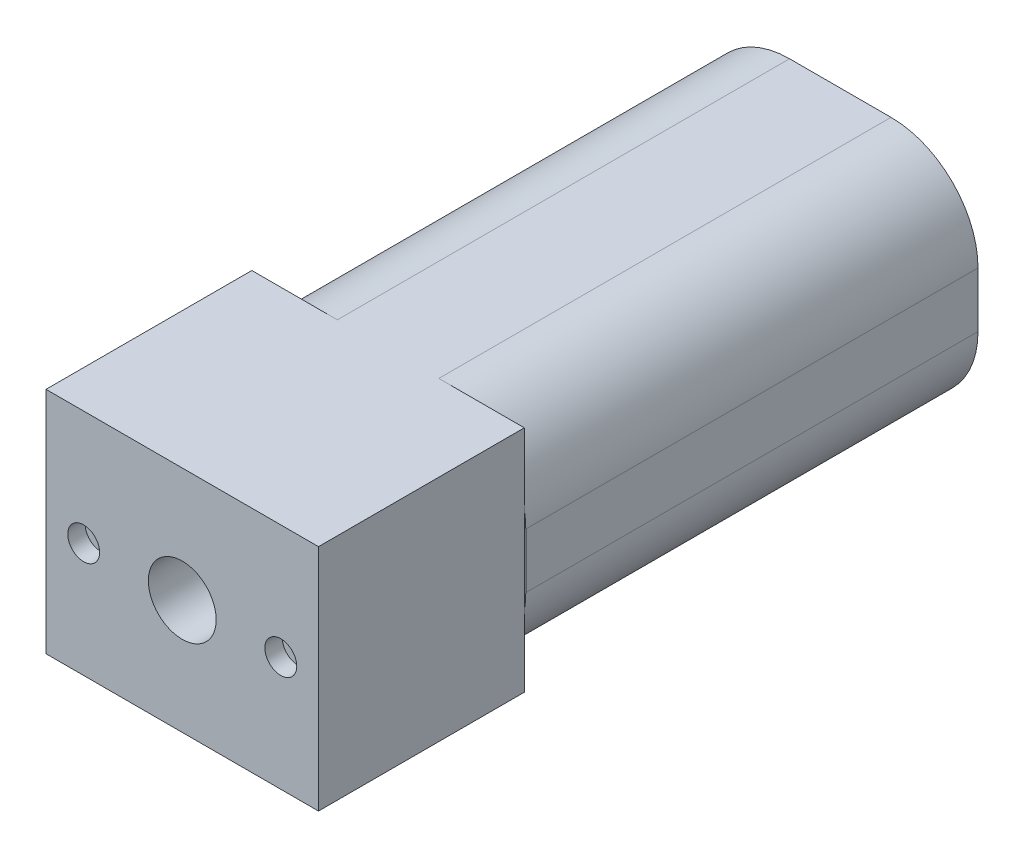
from build123d import *

# Parameters (mm, degrees)
BOSS_EXTRUDE1_DEPTH = 19.812
SKETCH2_W           = 11.938
SKETCH2_H           = 10.033
BOSS_EXTRUDE2_DEPTH = 9.017
SKETCH3_R           = 1.4859
CUT_EXTRUDE1_DEPTH  = 7.62
SKETCH4_R           = 0.6985
CUT_EXTRUDE2_DEPTH  = 0.762


with BuildPart() as part:
    # Sketch1 → Boss-Extrude1 (new body)
    with BuildSketch(Plane.XY):
        with BuildLine():
            Line((-2.2225, -5.0165), (2.2225, -5.0165))
            ThreePointArc((2.2225, -5.0165), (4.916576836, -3.900576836), (6.0325, -1.2065))
            Line((6.0325, -1.2065), (6.0325, 1.2065))
            ThreePointArc((6.0325, 1.2065), (4.916576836, 3.900576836), (2.2225, 5.0165))
            Line((2.2225, 5.0165), (-2.2225, 5.0165))
            ThreePointArc((-2.2225, 5.0165), (-4.916576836, 3.900576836), (-6.0325, 1.2065))
            Line((-6.0325, 1.2065), (-6.0325, -1.2065))
            ThreePointArc((-6.0325, -1.2065), (-4.916576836, -3.900576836), (-2.2225, -5.0165))
        make_face()
    extrude(amount=BOSS_EXTRUDE1_DEPTH)

    # Sketch2 → Boss-Extrude2 (add)
    with BuildSketch(Plane.XY.offset(19.812)):
        Rectangle(SKETCH2_W, SKETCH2_H)
    extrude(amount=BOSS_EXTRUDE2_DEPTH)

    # Sketch3 → Cut-Extrude1 (cut)
    with BuildSketch(Plane.XY.offset(28.829)):
        Circle(SKETCH3_R)
    extrude(amount=-CUT_EXTRUDE1_DEPTH, mode=Mode.SUBTRACT)

    # Sketch4 → Cut-Extrude2 (cut)
    with BuildSketch(Plane.XY.offset(28.829)):
        with Locations((-4.318, 0)):
            Circle(SKETCH4_R)
        with Locations((4.318, 0)):
            Circle(SKETCH4_R)
    extrude(amount=-CUT_EXTRUDE2_DEPTH, mode=Mode.SUBTRACT)


solid = part.part
